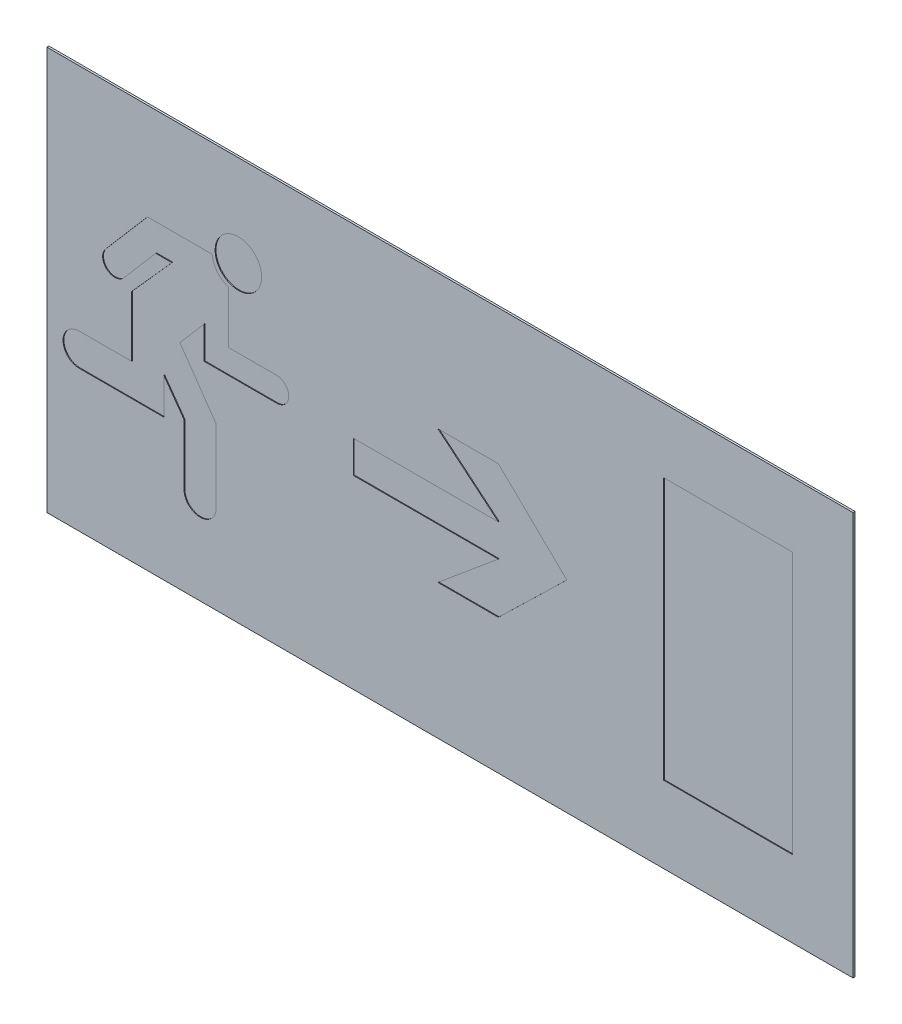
ISO-10303-21;
HEADER;
FILE_DESCRIPTION(('STEP AP214'),'2;1');
FILE_NAME('part.step','',(''),(''),'','','');
FILE_SCHEMA(('AUTOMOTIVE_DESIGN { 1 0 10303 214 1 1 1 1 }'));
ENDSEC;
DATA;
#1=APPLICATION_CONTEXT('core data for automotive mechanical design processes');
#2=APPLICATION_PROTOCOL_DEFINITION('international standard','automotive_design',2000,#1);
#3=PRODUCT_CONTEXT('',#1,'mechanical');
#4=PRODUCT('Part','Part','',(#3));
#5=PRODUCT_RELATED_PRODUCT_CATEGORY('part','',(#4));
#6=PRODUCT_DEFINITION_FORMATION('','',#4);
#7=PRODUCT_DEFINITION_CONTEXT('part definition',#1,'design');
#8=PRODUCT_DEFINITION('design','',#6,#7);
#9=PRODUCT_DEFINITION_SHAPE('','',#8);
#10=(LENGTH_UNIT() NAMED_UNIT(*) SI_UNIT(.MILLI.,.METRE.));
#11=(NAMED_UNIT(*) PLANE_ANGLE_UNIT() SI_UNIT($,.RADIAN.));
#12=(NAMED_UNIT(*) SI_UNIT($,.STERADIAN.) SOLID_ANGLE_UNIT());
#13=UNCERTAINTY_MEASURE_WITH_UNIT(LENGTH_MEASURE(1.E-05),#10,'distance_accuracy_value','');
#14=(GEOMETRIC_REPRESENTATION_CONTEXT(3) GLOBAL_UNCERTAINTY_ASSIGNED_CONTEXT((#13)) GLOBAL_UNIT_ASSIGNED_CONTEXT((#10,
#11,#12)) REPRESENTATION_CONTEXT('',''));
#15=CARTESIAN_POINT('',(0.,0.,0.));
#16=DIRECTION('',(0.,0.,1.));
#17=DIRECTION('',(1.,0.,0.));
#18=AXIS2_PLACEMENT_3D('',#15,#16,#17);
#19=CARTESIAN_POINT('',(-100.,50.,0.5));
#20=DIRECTION('',(1.,0.,0.));
#21=DIRECTION('',(0.,1.,0.));
#22=AXIS2_PLACEMENT_3D('',#19,#20,#21);
#23=PLANE('',#22);
#24=DIRECTION('',(0.,-1.,0.));
#25=VECTOR('',#24,1.);
#26=CARTESIAN_POINT('',(-100.,50.,0.));
#27=LINE('',#26,#25);
#28=CARTESIAN_POINT('',(-100.,50.,0.));
#29=VERTEX_POINT('',#28);
#30=CARTESIAN_POINT('',(-100.,-50.,0.));
#31=VERTEX_POINT('',#30);
#32=EDGE_CURVE('E577',#29,#31,#27,.T.);
#33=ORIENTED_EDGE('',*,*,#32,.T.);
#34=DIRECTION('',(0.,0.,-1.));
#35=VECTOR('',#34,1.);
#36=CARTESIAN_POINT('',(-100.,-50.,0.5));
#37=LINE('',#36,#35);
#38=CARTESIAN_POINT('',(-100.,-50.,0.5));
#39=VERTEX_POINT('',#38);
#40=EDGE_CURVE('E11',#39,#31,#37,.T.);
#41=ORIENTED_EDGE('',*,*,#40,.F.);
#42=DIRECTION('',(0.,-1.,0.));
#43=VECTOR('',#42,1.);
#44=CARTESIAN_POINT('',(-100.,50.,0.5));
#45=LINE('',#44,#43);
#46=CARTESIAN_POINT('',(-100.,50.,0.5));
#47=VERTEX_POINT('',#46);
#48=EDGE_CURVE('E592',#47,#39,#45,.T.);
#49=ORIENTED_EDGE('',*,*,#48,.F.);
#50=DIRECTION('',(0.,0.,-1.));
#51=VECTOR('',#50,1.);
#52=CARTESIAN_POINT('',(-100.,50.,0.5));
#53=LINE('',#52,#51);
#54=EDGE_CURVE('E601',#47,#29,#53,.T.);
#55=ORIENTED_EDGE('',*,*,#54,.T.);
#56=EDGE_LOOP('',(#33,#41,#49,#55));
#57=FACE_BOUND('',#56,.T.);
#58=ADVANCED_FACE('F32',(#57),#23,.F.);
#59=CARTESIAN_POINT('',(-100.,-50.,0.5));
#60=DIRECTION('',(0.,1.,0.));
#61=DIRECTION('',(0.,0.,1.));
#62=AXIS2_PLACEMENT_3D('',#59,#60,#61);
#63=PLANE('',#62);
#64=DIRECTION('',(1.,0.,0.));
#65=VECTOR('',#64,1.);
#66=CARTESIAN_POINT('',(-100.,-50.,0.));
#67=LINE('',#66,#65);
#68=CARTESIAN_POINT('',(100.,-50.,0.));
#69=VERTEX_POINT('',#68);
#70=EDGE_CURVE('E586',#31,#69,#67,.T.);
#71=ORIENTED_EDGE('',*,*,#70,.T.);
#72=DIRECTION('',(0.,0.,-1.));
#73=VECTOR('',#72,1.);
#74=CARTESIAN_POINT('',(100.,-50.,0.5));
#75=LINE('',#74,#73);
#76=CARTESIAN_POINT('',(100.,-50.,0.5));
#77=VERTEX_POINT('',#76);
#78=EDGE_CURVE('E39',#77,#69,#75,.T.);
#79=ORIENTED_EDGE('',*,*,#78,.F.);
#80=DIRECTION('',(1.,0.,0.));
#81=VECTOR('',#80,1.);
#82=CARTESIAN_POINT('',(-100.,-50.,0.5));
#83=LINE('',#82,#81);
#84=EDGE_CURVE('E595',#39,#77,#83,.T.);
#85=ORIENTED_EDGE('',*,*,#84,.F.);
#86=ORIENTED_EDGE('',*,*,#40,.T.);
#87=EDGE_LOOP('',(#71,#79,#85,#86));
#88=FACE_BOUND('',#87,.T.);
#89=ADVANCED_FACE('F626',(#88),#63,.F.);
#90=CARTESIAN_POINT('',(100.,50.,0.5));
#91=DIRECTION('',(-1.,0.,0.));
#92=DIRECTION('',(0.,-1.,0.));
#93=AXIS2_PLACEMENT_3D('',#90,#91,#92);
#94=PLANE('',#93);
#95=DIRECTION('',(0.,1.,0.));
#96=VECTOR('',#95,1.);
#97=CARTESIAN_POINT('',(100.,50.,0.));
#98=LINE('',#97,#96);
#99=CARTESIAN_POINT('',(100.,50.,0.));
#100=VERTEX_POINT('',#99);
#101=EDGE_CURVE('E588',#69,#100,#98,.T.);
#102=ORIENTED_EDGE('',*,*,#101,.T.);
#103=DIRECTION('',(0.,0.,-1.));
#104=VECTOR('',#103,1.);
#105=CARTESIAN_POINT('',(100.,50.,0.5));
#106=LINE('',#105,#104);
#107=CARTESIAN_POINT('',(100.,50.,0.5));
#108=VERTEX_POINT('',#107);
#109=EDGE_CURVE('E604',#108,#100,#106,.T.);
#110=ORIENTED_EDGE('',*,*,#109,.F.);
#111=DIRECTION('',(0.,1.,0.));
#112=VECTOR('',#111,1.);
#113=CARTESIAN_POINT('',(100.,50.,0.5));
#114=LINE('',#113,#112);
#115=EDGE_CURVE('E597',#77,#108,#114,.T.);
#116=ORIENTED_EDGE('',*,*,#115,.F.);
#117=ORIENTED_EDGE('',*,*,#78,.T.);
#118=EDGE_LOOP('',(#102,#110,#116,#117));
#119=FACE_BOUND('',#118,.T.);
#120=ADVANCED_FACE('F611',(#119),#94,.F.);
#121=CARTESIAN_POINT('',(-100.,50.,0.5));
#122=DIRECTION('',(0.,-1.,0.));
#123=DIRECTION('',(0.,0.,-1.));
#124=AXIS2_PLACEMENT_3D('',#121,#122,#123);
#125=PLANE('',#124);
#126=DIRECTION('',(-1.,0.,0.));
#127=VECTOR('',#126,1.);
#128=CARTESIAN_POINT('',(-100.,50.,0.));
#129=LINE('',#128,#127);
#130=EDGE_CURVE('E590',#100,#29,#129,.T.);
#131=ORIENTED_EDGE('',*,*,#130,.T.);
#132=ORIENTED_EDGE('',*,*,#54,.F.);
#133=DIRECTION('',(-1.,0.,0.));
#134=VECTOR('',#133,1.);
#135=CARTESIAN_POINT('',(-100.,50.,0.5));
#136=LINE('',#135,#134);
#137=EDGE_CURVE('E599',#108,#47,#136,.T.);
#138=ORIENTED_EDGE('',*,*,#137,.F.);
#139=ORIENTED_EDGE('',*,*,#109,.T.);
#140=EDGE_LOOP('',(#131,#132,#138,#139));
#141=FACE_BOUND('',#140,.T.);
#142=ADVANCED_FACE('F620',(#141),#125,.F.);
#143=CARTESIAN_POINT('',(-100.,-50.,0.5));
#144=DIRECTION('',(0.,0.,1.));
#145=DIRECTION('',(1.,0.,0.));
#146=AXIS2_PLACEMENT_3D('',#143,#144,#145);
#147=PLANE('',#146);
#148=CARTESIAN_POINT('',(-52.5,27.25,0.5));
#149=DIRECTION('',(0.,0.,1.));
#150=DIRECTION('',(1.,0.,0.));
#151=AXIS2_PLACEMENT_3D('',#148,#149,#150);
#152=CIRCLE('',#151,5.76777082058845);
#153=CARTESIAN_POINT('',(-46.7322291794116,27.25,0.5));
#154=VERTEX_POINT('',#153);
#155=EDGE_CURVE('E803',#154,#154,#152,.T.);
#156=ORIENTED_EDGE('',*,*,#155,.F.);
#157=EDGE_LOOP('',(#156));
#158=FACE_BOUND('',#157,.T.);
#159=DIRECTION('',(-0.666116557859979,-0.745847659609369,0.));
#160=VECTOR('',#159,1.);
#161=CARTESIAN_POINT('',(-79.,7.99999999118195,0.5));
#162=LINE('',#161,#160);
#163=CARTESIAN_POINT('',(-69.,19.1969542,0.5));
#164=VERTEX_POINT('',#163);
#165=CARTESIAN_POINT('',(-79.,7.99999999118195,0.5));
#166=VERTEX_POINT('',#165);
#167=EDGE_CURVE('E46',#164,#166,#162,.T.);
#168=ORIENTED_EDGE('',*,*,#167,.F.);
#169=DIRECTION('',(1.,0.,0.));
#170=VECTOR('',#169,1.);
#171=CARTESIAN_POINT('',(-69.,19.1969542,0.5));
#172=LINE('',#171,#170);
#173=CARTESIAN_POINT('',(-73.,19.1969542,0.5));
#174=VERTEX_POINT('',#173);
#175=EDGE_CURVE('E370',#174,#164,#172,.T.);
#176=ORIENTED_EDGE('',*,*,#175,.F.);
#177=DIRECTION('',(0.651634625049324,0.758533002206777,0.));
#178=VECTOR('',#177,1.);
#179=CARTESIAN_POINT('',(-73.,19.1969542,0.5));
#180=LINE('',#179,#178);
#181=CARTESIAN_POINT('',(-80.9008478,9.99999999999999,0.5));
#182=VERTEX_POINT('',#181);
#183=EDGE_CURVE('E367',#182,#174,#180,.T.);
#184=ORIENTED_EDGE('',*,*,#183,.F.);
#185=CARTESIAN_POINT('',(-83.1764468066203,11.954903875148,0.5));
#186=DIRECTION('',(0.,0.,1.));
#187=DIRECTION('',(1.,0.,0.));
#188=AXIS2_PLACEMENT_3D('',#185,#186,#187);
#189=CIRCLE('',#188,3.);
#190=CARTESIAN_POINT('',(-85.45204581,13.9098077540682,0.5));
#191=VERTEX_POINT('',#190);
#192=EDGE_CURVE('E364',#191,#182,#189,.T.);
#193=ORIENTED_EDGE('',*,*,#192,.F.);
#194=DIRECTION('',(-0.651634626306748,-0.758533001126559,0.));
#195=VECTOR('',#194,1.);
#196=CARTESIAN_POINT('',(-85.45204581,13.9098077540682,0.5));
#197=LINE('',#196,#195);
#198=CARTESIAN_POINT('',(-75.06569758,25.9999999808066,0.5));
#199=VERTEX_POINT('',#198);
#200=EDGE_CURVE('E361',#199,#191,#197,.T.);
#201=ORIENTED_EDGE('',*,*,#200,.F.);
#202=DIRECTION('',(-1.,0.,0.));
#203=VECTOR('',#202,1.);
#204=CARTESIAN_POINT('',(-75.06569758,25.9999999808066,0.5));
#205=LINE('',#204,#203);
#206=CARTESIAN_POINT('',(-59.,25.9999999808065,0.5));
#207=VERTEX_POINT('',#206);
#208=EDGE_CURVE('E358',#207,#199,#205,.T.);
#209=ORIENTED_EDGE('',*,*,#208,.F.);
#210=CARTESIAN_POINT('',(-53.3208897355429,26.4432882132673,0.5));
#211=DIRECTION('',(0.,0.,-1.));
#212=DIRECTION('',(1.,0.,0.));
#213=AXIS2_PLACEMENT_3D('',#210,#211,#212);
#214=CIRCLE('',#213,5.69638463);
#215=CARTESIAN_POINT('',(-55.,21.,0.5));
#216=VERTEX_POINT('',#215);
#217=EDGE_CURVE('E355',#216,#207,#214,.T.);
#218=ORIENTED_EDGE('',*,*,#217,.F.);
#219=DIRECTION('',(0.,1.,0.));
#220=VECTOR('',#219,1.);
#221=CARTESIAN_POINT('',(-55.,21.,0.5));
#222=LINE('',#221,#220);
#223=CARTESIAN_POINT('',(-55.,7.99999999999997,0.5));
#224=VERTEX_POINT('',#223);
#225=EDGE_CURVE('E352',#224,#216,#222,.T.);
#226=ORIENTED_EDGE('',*,*,#225,.F.);
#227=DIRECTION('',(-1.,0.,0.));
#228=VECTOR('',#227,1.);
#229=CARTESIAN_POINT('',(-55.,7.99999999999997,0.5));
#230=LINE('',#229,#228);
#231=CARTESIAN_POINT('',(-43.,7.99999999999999,0.5));
#232=VERTEX_POINT('',#231);
#233=EDGE_CURVE('E349',#232,#224,#230,.T.);
#234=ORIENTED_EDGE('',*,*,#233,.F.);
#235=CARTESIAN_POINT('',(-43.,4.99999999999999,0.5));
#236=DIRECTION('',(0.,0.,1.));
#237=DIRECTION('',(1.,0.,0.));
#238=AXIS2_PLACEMENT_3D('',#235,#236,#237);
#239=CIRCLE('',#238,3.);
#240=CARTESIAN_POINT('',(-43.,1.99999999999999,0.5));
#241=VERTEX_POINT('',#240);
#242=EDGE_CURVE('E346',#241,#232,#239,.T.);
#243=ORIENTED_EDGE('',*,*,#242,.F.);
#244=DIRECTION('',(1.,0.,0.));
#245=VECTOR('',#244,1.);
#246=CARTESIAN_POINT('',(-61.,1.99999999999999,0.5));
#247=LINE('',#246,#245);
#248=CARTESIAN_POINT('',(-61.,1.99999999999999,0.5));
#249=VERTEX_POINT('',#248);
#250=EDGE_CURVE('E343',#249,#241,#247,.T.);
#251=ORIENTED_EDGE('',*,*,#250,.F.);
#252=DIRECTION('',(0.,-1.,0.));
#253=VECTOR('',#252,1.);
#254=CARTESIAN_POINT('',(-61.,9.99999999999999,0.5));
#255=LINE('',#254,#253);
#256=CARTESIAN_POINT('',(-61.,9.99999999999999,0.5));
#257=VERTEX_POINT('',#256);
#258=EDGE_CURVE('E340',#257,#249,#255,.T.);
#259=ORIENTED_EDGE('',*,*,#258,.F.);
#260=DIRECTION('',(0.650791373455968,0.759256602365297,0.));
#261=VECTOR('',#260,1.);
#262=CARTESIAN_POINT('',(-67.,3.,0.5));
#263=LINE('',#262,#261);
#264=CARTESIAN_POINT('',(-67.,3.,0.5));
#265=VERTEX_POINT('',#264);
#266=EDGE_CURVE('E337',#265,#257,#263,.T.);
#267=ORIENTED_EDGE('',*,*,#266,.F.);
#268=DIRECTION('',(-0.569209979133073,0.822192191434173,0.));
#269=VECTOR('',#268,1.);
#270=CARTESIAN_POINT('',(-57.99999999,-10.0000000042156,0.5));
#271=LINE('',#270,#269);
#272=CARTESIAN_POINT('',(-57.99999999,-10.0000000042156,0.5));
#273=VERTEX_POINT('',#272);
#274=EDGE_CURVE('E334',#273,#265,#271,.T.);
#275=ORIENTED_EDGE('',*,*,#274,.F.);
#276=DIRECTION('',(0.,1.,0.));
#277=VECTOR('',#276,1.);
#278=CARTESIAN_POINT('',(-57.99999999,-28.,0.5));
#279=LINE('',#278,#277);
#280=CARTESIAN_POINT('',(-57.99999999,-28.,0.5));
#281=VERTEX_POINT('',#280);
#282=EDGE_CURVE('E331',#281,#273,#279,.T.);
#283=ORIENTED_EDGE('',*,*,#282,.F.);
#284=CARTESIAN_POINT('',(-61.99999999,-28.,0.5));
#285=DIRECTION('',(0.,0.,1.));
#286=DIRECTION('',(1.,0.,0.));
#287=AXIS2_PLACEMENT_3D('',#284,#285,#286);
#288=CIRCLE('',#287,4.00000000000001);
#289=CARTESIAN_POINT('',(-65.99999999,-28.,0.5));
#290=VERTEX_POINT('',#289);
#291=EDGE_CURVE('E328',#290,#281,#288,.T.);
#292=ORIENTED_EDGE('',*,*,#291,.F.);
#293=DIRECTION('',(0.,-1.,0.));
#294=VECTOR('',#293,1.);
#295=CARTESIAN_POINT('',(-65.99999999,-13.,0.5));
#296=LINE('',#295,#294);
#297=CARTESIAN_POINT('',(-65.99999999,-13.,0.5));
#298=VERTEX_POINT('',#297);
#299=EDGE_CURVE('E325',#298,#290,#296,.T.);
#300=ORIENTED_EDGE('',*,*,#299,.F.);
#301=DIRECTION('',(0.58123819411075,-0.813733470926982,0.));
#302=VECTOR('',#301,1.);
#303=CARTESIAN_POINT('',(-70.9999999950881,-6.00000000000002,0.5));
#304=LINE('',#303,#302);
#305=CARTESIAN_POINT('',(-70.9999999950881,-6.00000000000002,0.5));
#306=VERTEX_POINT('',#305);
#307=EDGE_CURVE('E322',#306,#298,#304,.T.);
#308=ORIENTED_EDGE('',*,*,#307,.F.);
#309=DIRECTION('',(0.,1.,0.));
#310=VECTOR('',#309,1.);
#311=CARTESIAN_POINT('',(-70.9999999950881,-15.,0.5));
#312=LINE('',#311,#310);
#313=CARTESIAN_POINT('',(-70.9999999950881,-15.,0.5));
#314=VERTEX_POINT('',#313);
#315=EDGE_CURVE('E319',#314,#306,#312,.T.);
#316=ORIENTED_EDGE('',*,*,#315,.F.);
#317=DIRECTION('',(1.,0.,0.));
#318=VECTOR('',#317,1.);
#319=CARTESIAN_POINT('',(-92.,-15.,0.5));
#320=LINE('',#319,#318);
#321=CARTESIAN_POINT('',(-92.,-15.,0.5));
#322=VERTEX_POINT('',#321);
#323=EDGE_CURVE('E313',#322,#314,#320,.T.);
#324=ORIENTED_EDGE('',*,*,#323,.F.);
#325=CARTESIAN_POINT('',(-92.,-11.,0.5));
#326=DIRECTION('',(0.,0.,1.));
#327=DIRECTION('',(1.,0.,0.));
#328=AXIS2_PLACEMENT_3D('',#325,#326,#327);
#329=CIRCLE('',#328,4.);
#330=CARTESIAN_POINT('',(-92.,-7.,0.5));
#331=VERTEX_POINT('',#330);
#332=EDGE_CURVE('E311',#331,#322,#329,.T.);
#333=ORIENTED_EDGE('',*,*,#332,.F.);
#334=DIRECTION('',(-1.,0.,0.));
#335=VECTOR('',#334,1.);
#336=CARTESIAN_POINT('',(-92.,-7.,0.5));
#337=LINE('',#336,#335);
#338=CARTESIAN_POINT('',(-79.,-7.,0.5));
#339=VERTEX_POINT('',#338);
#340=EDGE_CURVE('E292',#339,#331,#337,.T.);
#341=ORIENTED_EDGE('',*,*,#340,.F.);
#342=DIRECTION('',(0.,-1.,0.));
#343=VECTOR('',#342,1.);
#344=CARTESIAN_POINT('',(-79.,-7.,0.5));
#345=LINE('',#344,#343);
#346=EDGE_CURVE('E303',#166,#339,#345,.T.);
#347=ORIENTED_EDGE('',*,*,#346,.F.);
#348=EDGE_LOOP('',(#168,#176,#184,#193,#201,#209,#218,#226,#234,#243,#251,#259,#267,#275,#283,
#292,#300,#308,#316,#324,#333,#341,#347));
#349=FACE_BOUND('',#348,.T.);
#350=DIRECTION('',(-1.,0.,0.));
#351=VECTOR('',#350,1.);
#352=CARTESIAN_POINT('',(12.0000000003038,4.,0.5));
#353=LINE('',#352,#351);
#354=CARTESIAN_POINT('',(12.0000000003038,4.,0.5));
#355=VERTEX_POINT('',#354);
#356=CARTESIAN_POINT('',(-24.,4.,0.5));
#357=VERTEX_POINT('',#356);
#358=EDGE_CURVE('E54',#355,#357,#353,.T.);
#359=ORIENTED_EDGE('',*,*,#358,.F.);
#360=DIRECTION('',(0.768221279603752,-0.640184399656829,0.));
#361=VECTOR('',#360,1.);
#362=CARTESIAN_POINT('',(-3.00000000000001,16.5,0.5));
#363=LINE('',#362,#361);
#364=CARTESIAN_POINT('',(-3.00000000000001,16.5,0.5));
#365=VERTEX_POINT('',#364);
#366=EDGE_CURVE('E503',#365,#355,#363,.T.);
#367=ORIENTED_EDGE('',*,*,#366,.F.);
#368=DIRECTION('',(-1.,0.,0.));
#369=VECTOR('',#368,1.);
#370=CARTESIAN_POINT('',(12.,16.5,0.5));
#371=LINE('',#370,#369);
#372=CARTESIAN_POINT('',(12.,16.5,0.5));
#373=VERTEX_POINT('',#372);
#374=EDGE_CURVE('E500',#373,#365,#371,.T.);
#375=ORIENTED_EDGE('',*,*,#374,.F.);
#376=DIRECTION('',(-0.717580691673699,0.696475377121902,0.));
#377=VECTOR('',#376,1.);
#378=CARTESIAN_POINT('',(12.,16.5,0.5));
#379=LINE('',#378,#377);
#380=CARTESIAN_POINT('',(29.0000000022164,0.,0.5));
#381=VERTEX_POINT('',#380);
#382=EDGE_CURVE('E497',#381,#373,#379,.T.);
#383=ORIENTED_EDGE('',*,*,#382,.F.);
#384=DIRECTION('',(0.717580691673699,0.696475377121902,0.));
#385=VECTOR('',#384,1.);
#386=CARTESIAN_POINT('',(29.0000000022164,0.,0.5));
#387=LINE('',#386,#385);
#388=CARTESIAN_POINT('',(12.,-16.5,0.5));
#389=VERTEX_POINT('',#388);
#390=EDGE_CURVE('E494',#389,#381,#387,.T.);
#391=ORIENTED_EDGE('',*,*,#390,.F.);
#392=DIRECTION('',(1.,0.,0.));
#393=VECTOR('',#392,1.);
#394=CARTESIAN_POINT('',(12.,-16.5,0.5));
#395=LINE('',#394,#393);
#396=CARTESIAN_POINT('',(-3.00000000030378,-16.5,0.5));
#397=VERTEX_POINT('',#396);
#398=EDGE_CURVE('E491',#397,#389,#395,.T.);
#399=ORIENTED_EDGE('',*,*,#398,.F.);
#400=DIRECTION('',(-0.768221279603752,-0.640184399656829,0.));
#401=VECTOR('',#400,1.);
#402=CARTESIAN_POINT('',(12.,-4.,0.5));
#403=LINE('',#402,#401);
#404=CARTESIAN_POINT('',(12.,-4.,0.5));
#405=VERTEX_POINT('',#404);
#406=EDGE_CURVE('E488',#405,#397,#403,.T.);
#407=ORIENTED_EDGE('',*,*,#406,.F.);
#408=DIRECTION('',(1.,0.,0.));
#409=VECTOR('',#408,1.);
#410=CARTESIAN_POINT('',(-24.,-4.,0.5));
#411=LINE('',#410,#409);
#412=CARTESIAN_POINT('',(-24.,-4.,0.5));
#413=VERTEX_POINT('',#412);
#414=EDGE_CURVE('E485',#413,#405,#411,.T.);
#415=ORIENTED_EDGE('',*,*,#414,.F.);
#416=DIRECTION('',(0.,-1.,0.));
#417=VECTOR('',#416,1.);
#418=CARTESIAN_POINT('',(-24.,4.,0.5));
#419=LINE('',#418,#417);
#420=EDGE_CURVE('E482',#357,#413,#419,.T.);
#421=ORIENTED_EDGE('',*,*,#420,.F.);
#422=EDGE_LOOP('',(#359,#367,#375,#383,#391,#399,#407,#415,#421));
#423=FACE_BOUND('',#422,.T.);
#424=DIRECTION('',(0.,-1.,0.));
#425=VECTOR('',#424,1.);
#426=CARTESIAN_POINT('',(53.,34.,0.5));
#427=LINE('',#426,#425);
#428=CARTESIAN_POINT('',(53.,34.,0.5));
#429=VERTEX_POINT('',#428);
#430=CARTESIAN_POINT('',(53.,-31.,0.5));
#431=VERTEX_POINT('',#430);
#432=EDGE_CURVE('E536',#429,#431,#427,.T.);
#433=ORIENTED_EDGE('',*,*,#432,.F.);
#434=DIRECTION('',(-1.,0.,0.));
#435=VECTOR('',#434,1.);
#436=CARTESIAN_POINT('',(53.,34.,0.5));
#437=LINE('',#436,#435);
#438=CARTESIAN_POINT('',(85.,34.,0.5));
#439=VERTEX_POINT('',#438);
#440=EDGE_CURVE('E559',#439,#429,#437,.T.);
#441=ORIENTED_EDGE('',*,*,#440,.F.);
#442=DIRECTION('',(0.,1.,0.));
#443=VECTOR('',#442,1.);
#444=CARTESIAN_POINT('',(85.,34.,0.5));
#445=LINE('',#444,#443);
#446=CARTESIAN_POINT('',(85.,-31.,0.5));
#447=VERTEX_POINT('',#446);
#448=EDGE_CURVE('E556',#447,#439,#445,.T.);
#449=ORIENTED_EDGE('',*,*,#448,.F.);
#450=DIRECTION('',(1.,0.,0.));
#451=VECTOR('',#450,1.);
#452=CARTESIAN_POINT('',(53.,-31.,0.5));
#453=LINE('',#452,#451);
#454=EDGE_CURVE('E553',#431,#447,#453,.T.);
#455=ORIENTED_EDGE('',*,*,#454,.F.);
#456=EDGE_LOOP('',(#433,#441,#449,#455));
#457=FACE_BOUND('',#456,.T.);
#458=ORIENTED_EDGE('',*,*,#48,.T.);
#459=ORIENTED_EDGE('',*,*,#84,.T.);
#460=ORIENTED_EDGE('',*,*,#115,.T.);
#461=ORIENTED_EDGE('',*,*,#137,.T.);
#462=EDGE_LOOP('',(#458,#459,#460,#461));
#463=FACE_BOUND('',#462,.T.);
#464=ADVANCED_FACE('F307',(#158,#349,#423,#457,#463),#147,.T.);
#465=CARTESIAN_POINT('',(-100.,-50.,0.));
#466=DIRECTION('',(0.,0.,1.));
#467=DIRECTION('',(1.,0.,0.));
#468=AXIS2_PLACEMENT_3D('',#465,#466,#467);
#469=PLANE('',#468);
#470=ORIENTED_EDGE('',*,*,#32,.F.);
#471=ORIENTED_EDGE('',*,*,#130,.F.);
#472=ORIENTED_EDGE('',*,*,#101,.F.);
#473=ORIENTED_EDGE('',*,*,#70,.F.);
#474=EDGE_LOOP('',(#470,#471,#472,#473));
#475=FACE_BOUND('',#474,.T.);
#476=ADVANCED_FACE('F617',(#475),#469,.F.);
#477=CARTESIAN_POINT('',(53.,34.,0.3));
#478=DIRECTION('',(-1.,0.,0.));
#479=DIRECTION('',(0.,-1.,0.));
#480=AXIS2_PLACEMENT_3D('',#477,#478,#479);
#481=PLANE('',#480);
#482=ORIENTED_EDGE('',*,*,#432,.T.);
#483=DIRECTION('',(0.,0.,1.));
#484=VECTOR('',#483,1.);
#485=CARTESIAN_POINT('',(53.,-31.,0.3));
#486=LINE('',#485,#484);
#487=CARTESIAN_POINT('',(53.,-31.,0.3));
#488=VERTEX_POINT('',#487);
#489=EDGE_CURVE('E574',#488,#431,#486,.T.);
#490=ORIENTED_EDGE('',*,*,#489,.F.);
#491=DIRECTION('',(0.,-1.,0.));
#492=VECTOR('',#491,1.);
#493=CARTESIAN_POINT('',(53.,34.,0.3));
#494=LINE('',#493,#492);
#495=CARTESIAN_POINT('',(53.,34.,0.3));
#496=VERTEX_POINT('',#495);
#497=EDGE_CURVE('E562',#496,#488,#494,.T.);
#498=ORIENTED_EDGE('',*,*,#497,.F.);
#499=DIRECTION('',(0.,0.,1.));
#500=VECTOR('',#499,1.);
#501=CARTESIAN_POINT('',(53.,34.,0.3));
#502=LINE('',#501,#500);
#503=EDGE_CURVE('E575',#496,#429,#502,.T.);
#504=ORIENTED_EDGE('',*,*,#503,.T.);
#505=EDGE_LOOP('',(#482,#490,#498,#504));
#506=FACE_BOUND('',#505,.T.);
#507=ADVANCED_FACE('F641',(#506),#481,.F.);
#508=CARTESIAN_POINT('',(53.,34.,0.3));
#509=DIRECTION('',(0.,1.,0.));
#510=DIRECTION('',(0.,0.,1.));
#511=AXIS2_PLACEMENT_3D('',#508,#509,#510);
#512=PLANE('',#511);
#513=ORIENTED_EDGE('',*,*,#440,.T.);
#514=ORIENTED_EDGE('',*,*,#503,.F.);
#515=DIRECTION('',(-1.,0.,0.));
#516=VECTOR('',#515,1.);
#517=CARTESIAN_POINT('',(53.,34.,0.3));
#518=LINE('',#517,#516);
#519=CARTESIAN_POINT('',(85.,34.,0.3));
#520=VERTEX_POINT('',#519);
#521=EDGE_CURVE('E571',#520,#496,#518,.T.);
#522=ORIENTED_EDGE('',*,*,#521,.F.);
#523=DIRECTION('',(0.,0.,1.));
#524=VECTOR('',#523,1.);
#525=CARTESIAN_POINT('',(85.,34.,0.3));
#526=LINE('',#525,#524);
#527=EDGE_CURVE('E578',#520,#439,#526,.T.);
#528=ORIENTED_EDGE('',*,*,#527,.T.);
#529=EDGE_LOOP('',(#513,#514,#522,#528));
#530=FACE_BOUND('',#529,.T.);
#531=ADVANCED_FACE('F644',(#530),#512,.F.);
#532=CARTESIAN_POINT('',(85.,34.,0.3));
#533=DIRECTION('',(1.,0.,0.));
#534=DIRECTION('',(0.,1.,0.));
#535=AXIS2_PLACEMENT_3D('',#532,#533,#534);
#536=PLANE('',#535);
#537=ORIENTED_EDGE('',*,*,#448,.T.);
#538=ORIENTED_EDGE('',*,*,#527,.F.);
#539=DIRECTION('',(0.,1.,0.));
#540=VECTOR('',#539,1.);
#541=CARTESIAN_POINT('',(85.,34.,0.3));
#542=LINE('',#541,#540);
#543=CARTESIAN_POINT('',(85.,-31.,0.3));
#544=VERTEX_POINT('',#543);
#545=EDGE_CURVE('E568',#544,#520,#542,.T.);
#546=ORIENTED_EDGE('',*,*,#545,.F.);
#547=DIRECTION('',(0.,0.,1.));
#548=VECTOR('',#547,1.);
#549=CARTESIAN_POINT('',(85.,-31.,0.3));
#550=LINE('',#549,#548);
#551=EDGE_CURVE('E580',#544,#447,#550,.T.);
#552=ORIENTED_EDGE('',*,*,#551,.T.);
#553=EDGE_LOOP('',(#537,#538,#546,#552));
#554=FACE_BOUND('',#553,.T.);
#555=ADVANCED_FACE('F650',(#554),#536,.F.);
#556=CARTESIAN_POINT('',(53.,-31.,0.3));
#557=DIRECTION('',(0.,-1.,0.));
#558=DIRECTION('',(1.,0.,0.));
#559=AXIS2_PLACEMENT_3D('',#556,#557,#558);
#560=PLANE('',#559);
#561=ORIENTED_EDGE('',*,*,#454,.T.);
#562=ORIENTED_EDGE('',*,*,#551,.F.);
#563=DIRECTION('',(1.,0.,0.));
#564=VECTOR('',#563,1.);
#565=CARTESIAN_POINT('',(53.,-31.,0.3));
#566=LINE('',#565,#564);
#567=EDGE_CURVE('E565',#488,#544,#566,.T.);
#568=ORIENTED_EDGE('',*,*,#567,.F.);
#569=ORIENTED_EDGE('',*,*,#489,.T.);
#570=EDGE_LOOP('',(#561,#562,#568,#569));
#571=FACE_BOUND('',#570,.T.);
#572=ADVANCED_FACE('F646',(#571),#560,.F.);
#573=CARTESIAN_POINT('',(53.,34.,0.3));
#574=DIRECTION('',(0.,0.,1.));
#575=DIRECTION('',(1.,0.,0.));
#576=AXIS2_PLACEMENT_3D('',#573,#574,#575);
#577=PLANE('',#576);
#578=ORIENTED_EDGE('',*,*,#497,.T.);
#579=ORIENTED_EDGE('',*,*,#567,.T.);
#580=ORIENTED_EDGE('',*,*,#545,.T.);
#581=ORIENTED_EDGE('',*,*,#521,.T.);
#582=EDGE_LOOP('',(#578,#579,#580,#581));
#583=FACE_BOUND('',#582,.T.);
#584=ADVANCED_FACE('F649',(#583),#577,.T.);
#585=CARTESIAN_POINT('',(12.0000000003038,4.,0.3));
#586=DIRECTION('',(0.,1.,0.));
#587=DIRECTION('',(-1.,0.,0.));
#588=AXIS2_PLACEMENT_3D('',#585,#586,#587);
#589=PLANE('',#588);
#590=ORIENTED_EDGE('',*,*,#358,.T.);
#591=DIRECTION('',(0.,0.,1.));
#592=VECTOR('',#591,1.);
#593=CARTESIAN_POINT('',(-24.,4.,0.3));
#594=LINE('',#593,#592);
#595=CARTESIAN_POINT('',(-24.,4.,0.3));
#596=VERTEX_POINT('',#595);
#597=EDGE_CURVE('E533',#596,#357,#594,.T.);
#598=ORIENTED_EDGE('',*,*,#597,.F.);
#599=DIRECTION('',(-1.,0.,0.));
#600=VECTOR('',#599,1.);
#601=CARTESIAN_POINT('',(12.0000000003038,4.,0.3));
#602=LINE('',#601,#600);
#603=CARTESIAN_POINT('',(12.0000000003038,4.,0.3));
#604=VERTEX_POINT('',#603);
#605=EDGE_CURVE('E506',#604,#596,#602,.T.);
#606=ORIENTED_EDGE('',*,*,#605,.F.);
#607=DIRECTION('',(0.,0.,1.));
#608=VECTOR('',#607,1.);
#609=CARTESIAN_POINT('',(12.0000000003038,4.,0.3));
#610=LINE('',#609,#608);
#611=EDGE_CURVE('E534',#604,#355,#610,.T.);
#612=ORIENTED_EDGE('',*,*,#611,.T.);
#613=EDGE_LOOP('',(#590,#598,#606,#612));
#614=FACE_BOUND('',#613,.T.);
#615=ADVANCED_FACE('F660',(#614),#589,.F.);
#616=CARTESIAN_POINT('',(-3.00000000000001,16.5,0.3));
#617=DIRECTION('',(-0.640184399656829,-0.768221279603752,0.));
#618=DIRECTION('',(0.768221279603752,-0.640184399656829,0.));
#619=AXIS2_PLACEMENT_3D('',#616,#617,#618);
#620=PLANE('',#619);
#621=ORIENTED_EDGE('',*,*,#366,.T.);
#622=ORIENTED_EDGE('',*,*,#611,.F.);
#623=DIRECTION('',(0.768221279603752,-0.640184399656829,0.));
#624=VECTOR('',#623,1.);
#625=CARTESIAN_POINT('',(-3.00000000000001,16.5,0.3));
#626=LINE('',#625,#624);
#627=CARTESIAN_POINT('',(-3.00000000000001,16.5,0.3));
#628=VERTEX_POINT('',#627);
#629=EDGE_CURVE('E530',#628,#604,#626,.T.);
#630=ORIENTED_EDGE('',*,*,#629,.F.);
#631=DIRECTION('',(0.,0.,1.));
#632=VECTOR('',#631,1.);
#633=CARTESIAN_POINT('',(-3.00000000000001,16.5,0.3));
#634=LINE('',#633,#632);
#635=EDGE_CURVE('E537',#628,#365,#634,.T.);
#636=ORIENTED_EDGE('',*,*,#635,.T.);
#637=EDGE_LOOP('',(#621,#622,#630,#636));
#638=FACE_BOUND('',#637,.T.);
#639=ADVANCED_FACE('F664',(#638),#620,.F.);
#640=CARTESIAN_POINT('',(12.,16.5,0.3));
#641=DIRECTION('',(0.,1.,0.));
#642=DIRECTION('',(0.,0.,1.));
#643=AXIS2_PLACEMENT_3D('',#640,#641,#642);
#644=PLANE('',#643);
#645=ORIENTED_EDGE('',*,*,#374,.T.);
#646=ORIENTED_EDGE('',*,*,#635,.F.);
#647=DIRECTION('',(-1.,0.,0.));
#648=VECTOR('',#647,1.);
#649=CARTESIAN_POINT('',(12.,16.5,0.3));
#650=LINE('',#649,#648);
#651=CARTESIAN_POINT('',(12.,16.5,0.3));
#652=VERTEX_POINT('',#651);
#653=EDGE_CURVE('E527',#652,#628,#650,.T.);
#654=ORIENTED_EDGE('',*,*,#653,.F.);
#655=DIRECTION('',(0.,0.,1.));
#656=VECTOR('',#655,1.);
#657=CARTESIAN_POINT('',(12.,16.5,0.3));
#658=LINE('',#657,#656);
#659=EDGE_CURVE('E539',#652,#373,#658,.T.);
#660=ORIENTED_EDGE('',*,*,#659,.T.);
#661=EDGE_LOOP('',(#645,#646,#654,#660));
#662=FACE_BOUND('',#661,.T.);
#663=ADVANCED_FACE('F689',(#662),#644,.F.);
#664=CARTESIAN_POINT('',(12.,16.5,0.3));
#665=DIRECTION('',(0.696475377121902,0.717580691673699,0.));
#666=DIRECTION('',(-0.717580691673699,0.696475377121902,0.));
#667=AXIS2_PLACEMENT_3D('',#664,#665,#666);
#668=PLANE('',#667);
#669=ORIENTED_EDGE('',*,*,#382,.T.);
#670=ORIENTED_EDGE('',*,*,#659,.F.);
#671=DIRECTION('',(-0.717580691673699,0.696475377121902,0.));
#672=VECTOR('',#671,1.);
#673=CARTESIAN_POINT('',(12.,16.5,0.3));
#674=LINE('',#673,#672);
#675=CARTESIAN_POINT('',(29.0000000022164,0.,0.3));
#676=VERTEX_POINT('',#675);
#677=EDGE_CURVE('E524',#676,#652,#674,.T.);
#678=ORIENTED_EDGE('',*,*,#677,.F.);
#679=DIRECTION('',(0.,0.,1.));
#680=VECTOR('',#679,1.);
#681=CARTESIAN_POINT('',(29.0000000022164,0.,0.3));
#682=LINE('',#681,#680);
#683=EDGE_CURVE('E541',#676,#381,#682,.T.);
#684=ORIENTED_EDGE('',*,*,#683,.T.);
#685=EDGE_LOOP('',(#669,#670,#678,#684));
#686=FACE_BOUND('',#685,.T.);
#687=ADVANCED_FACE('F685',(#686),#668,.F.);
#688=CARTESIAN_POINT('',(29.0000000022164,0.,0.3));
#689=DIRECTION('',(0.696475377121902,-0.717580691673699,0.));
#690=DIRECTION('',(0.717580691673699,0.696475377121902,0.));
#691=AXIS2_PLACEMENT_3D('',#688,#689,#690);
#692=PLANE('',#691);
#693=ORIENTED_EDGE('',*,*,#390,.T.);
#694=ORIENTED_EDGE('',*,*,#683,.F.);
#695=DIRECTION('',(0.717580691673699,0.696475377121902,0.));
#696=VECTOR('',#695,1.);
#697=CARTESIAN_POINT('',(29.0000000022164,0.,0.3));
#698=LINE('',#697,#696);
#699=CARTESIAN_POINT('',(12.,-16.5,0.3));
#700=VERTEX_POINT('',#699);
#701=EDGE_CURVE('E521',#700,#676,#698,.T.);
#702=ORIENTED_EDGE('',*,*,#701,.F.);
#703=DIRECTION('',(0.,0.,1.));
#704=VECTOR('',#703,1.);
#705=CARTESIAN_POINT('',(12.,-16.5,0.3));
#706=LINE('',#705,#704);
#707=EDGE_CURVE('E543',#700,#389,#706,.T.);
#708=ORIENTED_EDGE('',*,*,#707,.T.);
#709=EDGE_LOOP('',(#693,#694,#702,#708));
#710=FACE_BOUND('',#709,.T.);
#711=ADVANCED_FACE('F681',(#710),#692,.F.);
#712=CARTESIAN_POINT('',(12.,-16.5,0.3));
#713=DIRECTION('',(0.,-1.,0.));
#714=DIRECTION('',(1.,0.,0.));
#715=AXIS2_PLACEMENT_3D('',#712,#713,#714);
#716=PLANE('',#715);
#717=ORIENTED_EDGE('',*,*,#398,.T.);
#718=ORIENTED_EDGE('',*,*,#707,.F.);
#719=DIRECTION('',(1.,0.,0.));
#720=VECTOR('',#719,1.);
#721=CARTESIAN_POINT('',(12.,-16.5,0.3));
#722=LINE('',#721,#720);
#723=CARTESIAN_POINT('',(-3.00000000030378,-16.5,0.3));
#724=VERTEX_POINT('',#723);
#725=EDGE_CURVE('E518',#724,#700,#722,.T.);
#726=ORIENTED_EDGE('',*,*,#725,.F.);
#727=DIRECTION('',(0.,0.,1.));
#728=VECTOR('',#727,1.);
#729=CARTESIAN_POINT('',(-3.00000000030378,-16.5,0.3));
#730=LINE('',#729,#728);
#731=EDGE_CURVE('E545',#724,#397,#730,.T.);
#732=ORIENTED_EDGE('',*,*,#731,.T.);
#733=EDGE_LOOP('',(#717,#718,#726,#732));
#734=FACE_BOUND('',#733,.T.);
#735=ADVANCED_FACE('F677',(#734),#716,.F.);
#736=CARTESIAN_POINT('',(12.,-4.,0.3));
#737=DIRECTION('',(-0.640184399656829,0.768221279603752,0.));
#738=DIRECTION('',(-0.768221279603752,-0.640184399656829,0.));
#739=AXIS2_PLACEMENT_3D('',#736,#737,#738);
#740=PLANE('',#739);
#741=ORIENTED_EDGE('',*,*,#406,.T.);
#742=ORIENTED_EDGE('',*,*,#731,.F.);
#743=DIRECTION('',(-0.768221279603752,-0.640184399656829,0.));
#744=VECTOR('',#743,1.);
#745=CARTESIAN_POINT('',(12.,-4.,0.3));
#746=LINE('',#745,#744);
#747=CARTESIAN_POINT('',(12.,-4.,0.3));
#748=VERTEX_POINT('',#747);
#749=EDGE_CURVE('E515',#748,#724,#746,.T.);
#750=ORIENTED_EDGE('',*,*,#749,.F.);
#751=DIRECTION('',(0.,0.,1.));
#752=VECTOR('',#751,1.);
#753=CARTESIAN_POINT('',(12.,-4.,0.3));
#754=LINE('',#753,#752);
#755=EDGE_CURVE('E547',#748,#405,#754,.T.);
#756=ORIENTED_EDGE('',*,*,#755,.T.);
#757=EDGE_LOOP('',(#741,#742,#750,#756));
#758=FACE_BOUND('',#757,.T.);
#759=ADVANCED_FACE('F673',(#758),#740,.F.);
#760=CARTESIAN_POINT('',(-24.,-4.,0.3));
#761=DIRECTION('',(0.,-1.,0.));
#762=DIRECTION('',(0.,0.,-1.));
#763=AXIS2_PLACEMENT_3D('',#760,#761,#762);
#764=PLANE('',#763);
#765=ORIENTED_EDGE('',*,*,#414,.T.);
#766=ORIENTED_EDGE('',*,*,#755,.F.);
#767=DIRECTION('',(1.,0.,0.));
#768=VECTOR('',#767,1.);
#769=CARTESIAN_POINT('',(-24.,-4.,0.3));
#770=LINE('',#769,#768);
#771=CARTESIAN_POINT('',(-24.,-4.,0.3));
#772=VERTEX_POINT('',#771);
#773=EDGE_CURVE('E512',#772,#748,#770,.T.);
#774=ORIENTED_EDGE('',*,*,#773,.F.);
#775=DIRECTION('',(0.,0.,1.));
#776=VECTOR('',#775,1.);
#777=CARTESIAN_POINT('',(-24.,-4.,0.3));
#778=LINE('',#777,#776);
#779=EDGE_CURVE('E549',#772,#413,#778,.T.);
#780=ORIENTED_EDGE('',*,*,#779,.T.);
#781=EDGE_LOOP('',(#765,#766,#774,#780));
#782=FACE_BOUND('',#781,.T.);
#783=ADVANCED_FACE('F669',(#782),#764,.F.);
#784=CARTESIAN_POINT('',(-24.,4.,0.3));
#785=DIRECTION('',(-1.,0.,0.));
#786=DIRECTION('',(0.,0.,1.));
#787=AXIS2_PLACEMENT_3D('',#784,#785,#786);
#788=PLANE('',#787);
#789=ORIENTED_EDGE('',*,*,#420,.T.);
#790=ORIENTED_EDGE('',*,*,#779,.F.);
#791=DIRECTION('',(0.,-1.,0.));
#792=VECTOR('',#791,1.);
#793=CARTESIAN_POINT('',(-24.,4.,0.3));
#794=LINE('',#793,#792);
#795=EDGE_CURVE('E509',#596,#772,#794,.T.);
#796=ORIENTED_EDGE('',*,*,#795,.F.);
#797=ORIENTED_EDGE('',*,*,#597,.T.);
#798=EDGE_LOOP('',(#789,#790,#796,#797));
#799=FACE_BOUND('',#798,.T.);
#800=ADVANCED_FACE('F665',(#799),#788,.F.);
#801=CARTESIAN_POINT('',(-24.,4.,0.3));
#802=DIRECTION('',(0.,0.,1.));
#803=DIRECTION('',(1.,0.,0.));
#804=AXIS2_PLACEMENT_3D('',#801,#802,#803);
#805=PLANE('',#804);
#806=ORIENTED_EDGE('',*,*,#605,.T.);
#807=ORIENTED_EDGE('',*,*,#795,.T.);
#808=ORIENTED_EDGE('',*,*,#773,.T.);
#809=ORIENTED_EDGE('',*,*,#749,.T.);
#810=ORIENTED_EDGE('',*,*,#725,.T.);
#811=ORIENTED_EDGE('',*,*,#701,.T.);
#812=ORIENTED_EDGE('',*,*,#677,.T.);
#813=ORIENTED_EDGE('',*,*,#653,.T.);
#814=ORIENTED_EDGE('',*,*,#629,.T.);
#815=EDGE_LOOP('',(#806,#807,#808,#809,#810,#811,#812,#813,#814));
#816=FACE_BOUND('',#815,.T.);
#817=ADVANCED_FACE('F668',(#816),#805,.T.);
#818=CARTESIAN_POINT('',(-79.,7.99999999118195,0.3));
#819=DIRECTION('',(-0.745847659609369,0.666116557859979,0.));
#820=DIRECTION('',(-0.666116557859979,-0.745847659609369,0.));
#821=AXIS2_PLACEMENT_3D('',#818,#819,#820);
#822=PLANE('',#821);
#823=ORIENTED_EDGE('',*,*,#167,.T.);
#824=DIRECTION('',(0.,0.,1.));
#825=VECTOR('',#824,1.);
#826=CARTESIAN_POINT('',(-79.,7.99999999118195,0.3));
#827=LINE('',#826,#825);
#828=CARTESIAN_POINT('',(-79.,7.99999999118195,0.3));
#829=VERTEX_POINT('',#828);
#830=EDGE_CURVE('E300',#829,#166,#827,.T.);
#831=ORIENTED_EDGE('',*,*,#830,.F.);
#832=DIRECTION('',(-0.666116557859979,-0.745847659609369,0.));
#833=VECTOR('',#832,1.);
#834=CARTESIAN_POINT('',(-79.,7.99999999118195,0.3));
#835=LINE('',#834,#833);
#836=CARTESIAN_POINT('',(-69.,19.1969542,0.3));
#837=VERTEX_POINT('',#836);
#838=EDGE_CURVE('E373',#837,#829,#835,.T.);
#839=ORIENTED_EDGE('',*,*,#838,.F.);
#840=DIRECTION('',(0.,0.,1.));
#841=VECTOR('',#840,1.);
#842=CARTESIAN_POINT('',(-69.,19.1969542,0.3));
#843=LINE('',#842,#841);
#844=EDGE_CURVE('E439',#837,#164,#843,.T.);
#845=ORIENTED_EDGE('',*,*,#844,.T.);
#846=EDGE_LOOP('',(#823,#831,#839,#845));
#847=FACE_BOUND('',#846,.T.);
#848=ADVANCED_FACE('F699',(#847),#822,.F.);
#849=CARTESIAN_POINT('',(-69.,19.1969542,0.3));
#850=DIRECTION('',(0.,-1.,0.));
#851=DIRECTION('',(0.,0.,-1.));
#852=AXIS2_PLACEMENT_3D('',#849,#850,#851);
#853=PLANE('',#852);
#854=ORIENTED_EDGE('',*,*,#175,.T.);
#855=ORIENTED_EDGE('',*,*,#844,.F.);
#856=DIRECTION('',(1.,0.,0.));
#857=VECTOR('',#856,1.);
#858=CARTESIAN_POINT('',(-69.,19.1969542,0.3));
#859=LINE('',#858,#857);
#860=CARTESIAN_POINT('',(-73.,19.1969542,0.3));
#861=VERTEX_POINT('',#860);
#862=EDGE_CURVE('E436',#861,#837,#859,.T.);
#863=ORIENTED_EDGE('',*,*,#862,.F.);
#864=DIRECTION('',(0.,0.,1.));
#865=VECTOR('',#864,1.);
#866=CARTESIAN_POINT('',(-73.,19.1969542,0.3));
#867=LINE('',#866,#865);
#868=EDGE_CURVE('E441',#861,#174,#867,.T.);
#869=ORIENTED_EDGE('',*,*,#868,.T.);
#870=EDGE_LOOP('',(#854,#855,#863,#869));
#871=FACE_BOUND('',#870,.T.);
#872=ADVANCED_FACE('F703',(#871),#853,.F.);
#873=CARTESIAN_POINT('',(-73.,19.1969542,0.3));
#874=DIRECTION('',(0.758533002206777,-0.651634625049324,0.));
#875=DIRECTION('',(0.651634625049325,0.758533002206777,0.));
#876=AXIS2_PLACEMENT_3D('',#873,#874,#875);
#877=PLANE('',#876);
#878=ORIENTED_EDGE('',*,*,#183,.T.);
#879=ORIENTED_EDGE('',*,*,#868,.F.);
#880=DIRECTION('',(0.651634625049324,0.758533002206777,0.));
#881=VECTOR('',#880,1.);
#882=CARTESIAN_POINT('',(-73.,19.1969542,0.3));
#883=LINE('',#882,#881);
#884=CARTESIAN_POINT('',(-80.9008478,9.99999999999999,0.3));
#885=VERTEX_POINT('',#884);
#886=EDGE_CURVE('E433',#885,#861,#883,.T.);
#887=ORIENTED_EDGE('',*,*,#886,.F.);
#888=DIRECTION('',(0.,0.,1.));
#889=VECTOR('',#888,1.);
#890=CARTESIAN_POINT('',(-80.9008478,9.99999999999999,0.3));
#891=LINE('',#890,#889);
#892=EDGE_CURVE('E443',#885,#182,#891,.T.);
#893=ORIENTED_EDGE('',*,*,#892,.T.);
#894=EDGE_LOOP('',(#878,#879,#887,#893));
#895=FACE_BOUND('',#894,.T.);
#896=ADVANCED_FACE('F780',(#895),#877,.F.);
#897=CARTESIAN_POINT('',(-83.1764468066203,11.954903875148,0.3));
#898=DIRECTION('',(0.,0.,1.));
#899=DIRECTION('',(1.,0.,0.));
#900=AXIS2_PLACEMENT_3D('',#897,#898,#899);
#901=CYLINDRICAL_SURFACE('',#900,3.);
#902=ORIENTED_EDGE('',*,*,#192,.T.);
#903=ORIENTED_EDGE('',*,*,#892,.F.);
#904=CARTESIAN_POINT('',(-83.1764468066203,11.954903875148,0.3));
#905=DIRECTION('',(0.,0.,1.));
#906=DIRECTION('',(1.,0.,0.));
#907=AXIS2_PLACEMENT_3D('',#904,#905,#906);
#908=CIRCLE('',#907,3.);
#909=CARTESIAN_POINT('',(-85.45204581,13.9098077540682,0.3));
#910=VERTEX_POINT('',#909);
#911=EDGE_CURVE('E430',#910,#885,#908,.T.);
#912=ORIENTED_EDGE('',*,*,#911,.F.);
#913=DIRECTION('',(0.,0.,1.));
#914=VECTOR('',#913,1.);
#915=CARTESIAN_POINT('',(-85.45204581,13.9098077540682,0.3));
#916=LINE('',#915,#914);
#917=EDGE_CURVE('E445',#910,#191,#916,.T.);
#918=ORIENTED_EDGE('',*,*,#917,.T.);
#919=EDGE_LOOP('',(#902,#903,#912,#918));
#920=FACE_BOUND('',#919,.T.);
#921=ADVANCED_FACE('F776',(#920),#901,.F.);
#922=CARTESIAN_POINT('',(-85.45204581,13.9098077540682,0.3));
#923=DIRECTION('',(-0.758533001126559,0.651634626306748,0.));
#924=DIRECTION('',(-0.651634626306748,-0.758533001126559,0.));
#925=AXIS2_PLACEMENT_3D('',#922,#923,#924);
#926=PLANE('',#925);
#927=ORIENTED_EDGE('',*,*,#200,.T.);
#928=ORIENTED_EDGE('',*,*,#917,.F.);
#929=DIRECTION('',(-0.651634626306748,-0.758533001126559,0.));
#930=VECTOR('',#929,1.);
#931=CARTESIAN_POINT('',(-85.45204581,13.9098077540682,0.3));
#932=LINE('',#931,#930);
#933=CARTESIAN_POINT('',(-75.06569758,25.9999999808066,0.3));
#934=VERTEX_POINT('',#933);
#935=EDGE_CURVE('E427',#934,#910,#932,.T.);
#936=ORIENTED_EDGE('',*,*,#935,.F.);
#937=DIRECTION('',(0.,0.,1.));
#938=VECTOR('',#937,1.);
#939=CARTESIAN_POINT('',(-75.06569758,25.9999999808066,0.3));
#940=LINE('',#939,#938);
#941=EDGE_CURVE('E447',#934,#199,#940,.T.);
#942=ORIENTED_EDGE('',*,*,#941,.T.);
#943=EDGE_LOOP('',(#927,#928,#936,#942));
#944=FACE_BOUND('',#943,.T.);
#945=ADVANCED_FACE('F772',(#944),#926,.F.);
#946=CARTESIAN_POINT('',(-75.06569758,25.9999999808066,0.3));
#947=DIRECTION('',(0.,1.,0.));
#948=DIRECTION('',(-1.,0.,0.));
#949=AXIS2_PLACEMENT_3D('',#946,#947,#948);
#950=PLANE('',#949);
#951=ORIENTED_EDGE('',*,*,#208,.T.);
#952=ORIENTED_EDGE('',*,*,#941,.F.);
#953=DIRECTION('',(-1.,0.,0.));
#954=VECTOR('',#953,1.);
#955=CARTESIAN_POINT('',(-75.06569758,25.9999999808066,0.3));
#956=LINE('',#955,#954);
#957=CARTESIAN_POINT('',(-59.,25.9999999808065,0.3));
#958=VERTEX_POINT('',#957);
#959=EDGE_CURVE('E424',#958,#934,#956,.T.);
#960=ORIENTED_EDGE('',*,*,#959,.F.);
#961=DIRECTION('',(0.,0.,1.));
#962=VECTOR('',#961,1.);
#963=CARTESIAN_POINT('',(-59.,25.9999999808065,0.3));
#964=LINE('',#963,#962);
#965=EDGE_CURVE('E449',#958,#207,#964,.T.);
#966=ORIENTED_EDGE('',*,*,#965,.T.);
#967=EDGE_LOOP('',(#951,#952,#960,#966));
#968=FACE_BOUND('',#967,.T.);
#969=ADVANCED_FACE('F768',(#968),#950,.F.);
#970=CARTESIAN_POINT('',(-53.3208897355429,26.4432882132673,0.3));
#971=DIRECTION('',(0.,0.,1.));
#972=DIRECTION('',(1.,0.,0.));
#973=AXIS2_PLACEMENT_3D('',#970,#971,#972);
#974=CYLINDRICAL_SURFACE('',#973,5.69638463);
#975=ORIENTED_EDGE('',*,*,#217,.T.);
#976=ORIENTED_EDGE('',*,*,#965,.F.);
#977=CARTESIAN_POINT('',(-53.3208897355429,26.4432882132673,0.3));
#978=DIRECTION('',(0.,0.,-1.));
#979=DIRECTION('',(1.,0.,0.));
#980=AXIS2_PLACEMENT_3D('',#977,#978,#979);
#981=CIRCLE('',#980,5.69638463);
#982=CARTESIAN_POINT('',(-55.,21.,0.3));
#983=VERTEX_POINT('',#982);
#984=EDGE_CURVE('E421',#983,#958,#981,.T.);
#985=ORIENTED_EDGE('',*,*,#984,.F.);
#986=DIRECTION('',(0.,0.,1.));
#987=VECTOR('',#986,1.);
#988=CARTESIAN_POINT('',(-55.,21.,0.3));
#989=LINE('',#988,#987);
#990=EDGE_CURVE('E451',#983,#216,#989,.T.);
#991=ORIENTED_EDGE('',*,*,#990,.T.);
#992=EDGE_LOOP('',(#975,#976,#985,#991));
#993=FACE_BOUND('',#992,.T.);
#994=ADVANCED_FACE('F764',(#993),#974,.T.);
#995=CARTESIAN_POINT('',(-55.,21.,0.3));
#996=DIRECTION('',(1.,0.,0.));
#997=DIRECTION('',(0.,1.,0.));
#998=AXIS2_PLACEMENT_3D('',#995,#996,#997);
#999=PLANE('',#998);
#1000=ORIENTED_EDGE('',*,*,#225,.T.);
#1001=ORIENTED_EDGE('',*,*,#990,.F.);
#1002=DIRECTION('',(0.,1.,0.));
#1003=VECTOR('',#1002,1.);
#1004=CARTESIAN_POINT('',(-55.,21.,0.3));
#1005=LINE('',#1004,#1003);
#1006=CARTESIAN_POINT('',(-55.,7.99999999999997,0.3));
#1007=VERTEX_POINT('',#1006);
#1008=EDGE_CURVE('E418',#1007,#983,#1005,.T.);
#1009=ORIENTED_EDGE('',*,*,#1008,.F.);
#1010=DIRECTION('',(0.,0.,1.));
#1011=VECTOR('',#1010,1.);
#1012=CARTESIAN_POINT('',(-55.,7.99999999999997,0.3));
#1013=LINE('',#1012,#1011);
#1014=EDGE_CURVE('E453',#1007,#224,#1013,.T.);
#1015=ORIENTED_EDGE('',*,*,#1014,.T.);
#1016=EDGE_LOOP('',(#1000,#1001,#1009,#1015));
#1017=FACE_BOUND('',#1016,.T.);
#1018=ADVANCED_FACE('F760',(#1017),#999,.F.);
#1019=CARTESIAN_POINT('',(-55.,7.99999999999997,0.3));
#1020=DIRECTION('',(0.,1.,0.));
#1021=DIRECTION('',(-1.,0.,0.));
#1022=AXIS2_PLACEMENT_3D('',#1019,#1020,#1021);
#1023=PLANE('',#1022);
#1024=ORIENTED_EDGE('',*,*,#233,.T.);
#1025=ORIENTED_EDGE('',*,*,#1014,.F.);
#1026=DIRECTION('',(-1.,0.,0.));
#1027=VECTOR('',#1026,1.);
#1028=CARTESIAN_POINT('',(-55.,7.99999999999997,0.3));
#1029=LINE('',#1028,#1027);
#1030=CARTESIAN_POINT('',(-43.,7.99999999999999,0.3));
#1031=VERTEX_POINT('',#1030);
#1032=EDGE_CURVE('E415',#1031,#1007,#1029,.T.);
#1033=ORIENTED_EDGE('',*,*,#1032,.F.);
#1034=DIRECTION('',(0.,0.,1.));
#1035=VECTOR('',#1034,1.);
#1036=CARTESIAN_POINT('',(-43.,7.99999999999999,0.3));
#1037=LINE('',#1036,#1035);
#1038=EDGE_CURVE('E455',#1031,#232,#1037,.T.);
#1039=ORIENTED_EDGE('',*,*,#1038,.T.);
#1040=EDGE_LOOP('',(#1024,#1025,#1033,#1039));
#1041=FACE_BOUND('',#1040,.T.);
#1042=ADVANCED_FACE('F756',(#1041),#1023,.F.);
#1043=CARTESIAN_POINT('',(-43.,4.99999999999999,0.3));
#1044=DIRECTION('',(0.,0.,1.));
#1045=DIRECTION('',(1.,0.,0.));
#1046=AXIS2_PLACEMENT_3D('',#1043,#1044,#1045);
#1047=CYLINDRICAL_SURFACE('',#1046,3.);
#1048=ORIENTED_EDGE('',*,*,#242,.T.);
#1049=ORIENTED_EDGE('',*,*,#1038,.F.);
#1050=CARTESIAN_POINT('',(-43.,4.99999999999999,0.3));
#1051=DIRECTION('',(0.,0.,1.));
#1052=DIRECTION('',(1.,0.,0.));
#1053=AXIS2_PLACEMENT_3D('',#1050,#1051,#1052);
#1054=CIRCLE('',#1053,3.);
#1055=CARTESIAN_POINT('',(-43.,1.99999999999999,0.3));
#1056=VERTEX_POINT('',#1055);
#1057=EDGE_CURVE('E412',#1056,#1031,#1054,.T.);
#1058=ORIENTED_EDGE('',*,*,#1057,.F.);
#1059=DIRECTION('',(0.,0.,1.));
#1060=VECTOR('',#1059,1.);
#1061=CARTESIAN_POINT('',(-43.,1.99999999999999,0.3));
#1062=LINE('',#1061,#1060);
#1063=EDGE_CURVE('E457',#1056,#241,#1062,.T.);
#1064=ORIENTED_EDGE('',*,*,#1063,.T.);
#1065=EDGE_LOOP('',(#1048,#1049,#1058,#1064));
#1066=FACE_BOUND('',#1065,.T.);
#1067=ADVANCED_FACE('F752',(#1066),#1047,.F.);
#1068=CARTESIAN_POINT('',(-61.,1.99999999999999,0.3));
#1069=DIRECTION('',(0.,-1.,0.));
#1070=DIRECTION('',(0.,0.,-1.));
#1071=AXIS2_PLACEMENT_3D('',#1068,#1069,#1070);
#1072=PLANE('',#1071);
#1073=ORIENTED_EDGE('',*,*,#250,.T.);
#1074=ORIENTED_EDGE('',*,*,#1063,.F.);
#1075=DIRECTION('',(1.,0.,0.));
#1076=VECTOR('',#1075,1.);
#1077=CARTESIAN_POINT('',(-61.,1.99999999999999,0.3));
#1078=LINE('',#1077,#1076);
#1079=CARTESIAN_POINT('',(-61.,1.99999999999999,0.3));
#1080=VERTEX_POINT('',#1079);
#1081=EDGE_CURVE('E409',#1080,#1056,#1078,.T.);
#1082=ORIENTED_EDGE('',*,*,#1081,.F.);
#1083=DIRECTION('',(0.,0.,1.));
#1084=VECTOR('',#1083,1.);
#1085=CARTESIAN_POINT('',(-61.,1.99999999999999,0.3));
#1086=LINE('',#1085,#1084);
#1087=EDGE_CURVE('E459',#1080,#249,#1086,.T.);
#1088=ORIENTED_EDGE('',*,*,#1087,.T.);
#1089=EDGE_LOOP('',(#1073,#1074,#1082,#1088));
#1090=FACE_BOUND('',#1089,.T.);
#1091=ADVANCED_FACE('F748',(#1090),#1072,.F.);
#1092=CARTESIAN_POINT('',(-61.,9.99999999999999,0.3));
#1093=DIRECTION('',(-1.,0.,0.));
#1094=DIRECTION('',(0.,0.,1.));
#1095=AXIS2_PLACEMENT_3D('',#1092,#1093,#1094);
#1096=PLANE('',#1095);
#1097=ORIENTED_EDGE('',*,*,#258,.T.);
#1098=ORIENTED_EDGE('',*,*,#1087,.F.);
#1099=DIRECTION('',(0.,-1.,0.));
#1100=VECTOR('',#1099,1.);
#1101=CARTESIAN_POINT('',(-61.,9.99999999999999,0.3));
#1102=LINE('',#1101,#1100);
#1103=CARTESIAN_POINT('',(-61.,9.99999999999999,0.3));
#1104=VERTEX_POINT('',#1103);
#1105=EDGE_CURVE('E406',#1104,#1080,#1102,.T.);
#1106=ORIENTED_EDGE('',*,*,#1105,.F.);
#1107=DIRECTION('',(0.,0.,1.));
#1108=VECTOR('',#1107,1.);
#1109=CARTESIAN_POINT('',(-61.,9.99999999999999,0.3));
#1110=LINE('',#1109,#1108);
#1111=EDGE_CURVE('E461',#1104,#257,#1110,.T.);
#1112=ORIENTED_EDGE('',*,*,#1111,.T.);
#1113=EDGE_LOOP('',(#1097,#1098,#1106,#1112));
#1114=FACE_BOUND('',#1113,.T.);
#1115=ADVANCED_FACE('F744',(#1114),#1096,.F.);
#1116=CARTESIAN_POINT('',(-67.,3.,0.3));
#1117=DIRECTION('',(0.759256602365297,-0.650791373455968,0.));
#1118=DIRECTION('',(0.650791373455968,0.759256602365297,0.));
#1119=AXIS2_PLACEMENT_3D('',#1116,#1117,#1118);
#1120=PLANE('',#1119);
#1121=ORIENTED_EDGE('',*,*,#266,.T.);
#1122=ORIENTED_EDGE('',*,*,#1111,.F.);
#1123=DIRECTION('',(0.650791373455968,0.759256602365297,0.));
#1124=VECTOR('',#1123,1.);
#1125=CARTESIAN_POINT('',(-67.,3.,0.3));
#1126=LINE('',#1125,#1124);
#1127=CARTESIAN_POINT('',(-67.,3.,0.3));
#1128=VERTEX_POINT('',#1127);
#1129=EDGE_CURVE('E403',#1128,#1104,#1126,.T.);
#1130=ORIENTED_EDGE('',*,*,#1129,.F.);
#1131=DIRECTION('',(0.,0.,1.));
#1132=VECTOR('',#1131,1.);
#1133=CARTESIAN_POINT('',(-67.,3.,0.3));
#1134=LINE('',#1133,#1132);
#1135=EDGE_CURVE('E463',#1128,#265,#1134,.T.);
#1136=ORIENTED_EDGE('',*,*,#1135,.T.);
#1137=EDGE_LOOP('',(#1121,#1122,#1130,#1136));
#1138=FACE_BOUND('',#1137,.T.);
#1139=ADVANCED_FACE('F740',(#1138),#1120,.F.);
#1140=CARTESIAN_POINT('',(-57.99999999,-10.0000000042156,0.3));
#1141=DIRECTION('',(0.822192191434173,0.569209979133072,0.));
#1142=DIRECTION('',(-0.569209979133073,0.822192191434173,0.));
#1143=AXIS2_PLACEMENT_3D('',#1140,#1141,#1142);
#1144=PLANE('',#1143);
#1145=ORIENTED_EDGE('',*,*,#274,.T.);
#1146=ORIENTED_EDGE('',*,*,#1135,.F.);
#1147=DIRECTION('',(-0.569209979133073,0.822192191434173,0.));
#1148=VECTOR('',#1147,1.);
#1149=CARTESIAN_POINT('',(-57.99999999,-10.0000000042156,0.3));
#1150=LINE('',#1149,#1148);
#1151=CARTESIAN_POINT('',(-57.99999999,-10.0000000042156,0.3));
#1152=VERTEX_POINT('',#1151);
#1153=EDGE_CURVE('E400',#1152,#1128,#1150,.T.);
#1154=ORIENTED_EDGE('',*,*,#1153,.F.);
#1155=DIRECTION('',(0.,0.,1.));
#1156=VECTOR('',#1155,1.);
#1157=CARTESIAN_POINT('',(-57.99999999,-10.0000000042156,0.3));
#1158=LINE('',#1157,#1156);
#1159=EDGE_CURVE('E465',#1152,#273,#1158,.T.);
#1160=ORIENTED_EDGE('',*,*,#1159,.T.);
#1161=EDGE_LOOP('',(#1145,#1146,#1154,#1160));
#1162=FACE_BOUND('',#1161,.T.);
#1163=ADVANCED_FACE('F736',(#1162),#1144,.F.);
#1164=CARTESIAN_POINT('',(-57.99999999,-28.,0.3));
#1165=DIRECTION('',(1.,0.,0.));
#1166=DIRECTION('',(0.,1.,0.));
#1167=AXIS2_PLACEMENT_3D('',#1164,#1165,#1166);
#1168=PLANE('',#1167);
#1169=ORIENTED_EDGE('',*,*,#282,.T.);
#1170=ORIENTED_EDGE('',*,*,#1159,.F.);
#1171=DIRECTION('',(0.,1.,0.));
#1172=VECTOR('',#1171,1.);
#1173=CARTESIAN_POINT('',(-57.99999999,-28.,0.3));
#1174=LINE('',#1173,#1172);
#1175=CARTESIAN_POINT('',(-57.99999999,-28.,0.3));
#1176=VERTEX_POINT('',#1175);
#1177=EDGE_CURVE('E397',#1176,#1152,#1174,.T.);
#1178=ORIENTED_EDGE('',*,*,#1177,.F.);
#1179=DIRECTION('',(0.,0.,1.));
#1180=VECTOR('',#1179,1.);
#1181=CARTESIAN_POINT('',(-57.99999999,-28.,0.3));
#1182=LINE('',#1181,#1180);
#1183=EDGE_CURVE('E467',#1176,#281,#1182,.T.);
#1184=ORIENTED_EDGE('',*,*,#1183,.T.);
#1185=EDGE_LOOP('',(#1169,#1170,#1178,#1184));
#1186=FACE_BOUND('',#1185,.T.);
#1187=ADVANCED_FACE('F732',(#1186),#1168,.F.);
#1188=CARTESIAN_POINT('',(-61.99999999,-28.,0.3));
#1189=DIRECTION('',(0.,0.,1.));
#1190=DIRECTION('',(1.,0.,0.));
#1191=AXIS2_PLACEMENT_3D('',#1188,#1189,#1190);
#1192=CYLINDRICAL_SURFACE('',#1191,4.00000000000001);
#1193=ORIENTED_EDGE('',*,*,#291,.T.);
#1194=ORIENTED_EDGE('',*,*,#1183,.F.);
#1195=CARTESIAN_POINT('',(-61.99999999,-28.,0.3));
#1196=DIRECTION('',(0.,0.,1.));
#1197=DIRECTION('',(1.,0.,0.));
#1198=AXIS2_PLACEMENT_3D('',#1195,#1196,#1197);
#1199=CIRCLE('',#1198,4.00000000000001);
#1200=CARTESIAN_POINT('',(-65.99999999,-28.,0.3));
#1201=VERTEX_POINT('',#1200);
#1202=EDGE_CURVE('E394',#1201,#1176,#1199,.T.);
#1203=ORIENTED_EDGE('',*,*,#1202,.F.);
#1204=DIRECTION('',(0.,0.,1.));
#1205=VECTOR('',#1204,1.);
#1206=CARTESIAN_POINT('',(-65.99999999,-28.,0.3));
#1207=LINE('',#1206,#1205);
#1208=EDGE_CURVE('E469',#1201,#290,#1207,.T.);
#1209=ORIENTED_EDGE('',*,*,#1208,.T.);
#1210=EDGE_LOOP('',(#1193,#1194,#1203,#1209));
#1211=FACE_BOUND('',#1210,.T.);
#1212=ADVANCED_FACE('F728',(#1211),#1192,.F.);
#1213=CARTESIAN_POINT('',(-65.99999999,-13.,0.3));
#1214=DIRECTION('',(-1.,0.,0.));
#1215=DIRECTION('',(0.,-1.,0.));
#1216=AXIS2_PLACEMENT_3D('',#1213,#1214,#1215);
#1217=PLANE('',#1216);
#1218=ORIENTED_EDGE('',*,*,#299,.T.);
#1219=ORIENTED_EDGE('',*,*,#1208,.F.);
#1220=DIRECTION('',(0.,-1.,0.));
#1221=VECTOR('',#1220,1.);
#1222=CARTESIAN_POINT('',(-65.99999999,-13.,0.3));
#1223=LINE('',#1222,#1221);
#1224=CARTESIAN_POINT('',(-65.99999999,-13.,0.3));
#1225=VERTEX_POINT('',#1224);
#1226=EDGE_CURVE('E391',#1225,#1201,#1223,.T.);
#1227=ORIENTED_EDGE('',*,*,#1226,.F.);
#1228=DIRECTION('',(0.,0.,1.));
#1229=VECTOR('',#1228,1.);
#1230=CARTESIAN_POINT('',(-65.99999999,-13.,0.3));
#1231=LINE('',#1230,#1229);
#1232=EDGE_CURVE('E471',#1225,#298,#1231,.T.);
#1233=ORIENTED_EDGE('',*,*,#1232,.T.);
#1234=EDGE_LOOP('',(#1218,#1219,#1227,#1233));
#1235=FACE_BOUND('',#1234,.T.);
#1236=ADVANCED_FACE('F724',(#1235),#1217,.F.);
#1237=CARTESIAN_POINT('',(-70.9999999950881,-6.00000000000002,0.3));
#1238=DIRECTION('',(-0.813733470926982,-0.58123819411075,0.));
#1239=DIRECTION('',(0.58123819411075,-0.813733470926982,0.));
#1240=AXIS2_PLACEMENT_3D('',#1237,#1238,#1239);
#1241=PLANE('',#1240);
#1242=ORIENTED_EDGE('',*,*,#307,.T.);
#1243=ORIENTED_EDGE('',*,*,#1232,.F.);
#1244=DIRECTION('',(0.58123819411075,-0.813733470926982,0.));
#1245=VECTOR('',#1244,1.);
#1246=CARTESIAN_POINT('',(-70.9999999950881,-6.00000000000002,0.3));
#1247=LINE('',#1246,#1245);
#1248=CARTESIAN_POINT('',(-70.9999999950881,-6.00000000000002,0.3));
#1249=VERTEX_POINT('',#1248);
#1250=EDGE_CURVE('E388',#1249,#1225,#1247,.T.);
#1251=ORIENTED_EDGE('',*,*,#1250,.F.);
#1252=DIRECTION('',(0.,0.,1.));
#1253=VECTOR('',#1252,1.);
#1254=CARTESIAN_POINT('',(-70.9999999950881,-6.00000000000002,0.3));
#1255=LINE('',#1254,#1253);
#1256=EDGE_CURVE('E473',#1249,#306,#1255,.T.);
#1257=ORIENTED_EDGE('',*,*,#1256,.T.);
#1258=EDGE_LOOP('',(#1242,#1243,#1251,#1257));
#1259=FACE_BOUND('',#1258,.T.);
#1260=ADVANCED_FACE('F720',(#1259),#1241,.F.);
#1261=CARTESIAN_POINT('',(-70.9999999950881,-15.,0.3));
#1262=DIRECTION('',(1.,0.,0.));
#1263=DIRECTION('',(0.,1.,0.));
#1264=AXIS2_PLACEMENT_3D('',#1261,#1262,#1263);
#1265=PLANE('',#1264);
#1266=ORIENTED_EDGE('',*,*,#315,.T.);
#1267=ORIENTED_EDGE('',*,*,#1256,.F.);
#1268=DIRECTION('',(0.,1.,0.));
#1269=VECTOR('',#1268,1.);
#1270=CARTESIAN_POINT('',(-70.9999999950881,-15.,0.3));
#1271=LINE('',#1270,#1269);
#1272=CARTESIAN_POINT('',(-70.9999999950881,-15.,0.3));
#1273=VERTEX_POINT('',#1272);
#1274=EDGE_CURVE('E385',#1273,#1249,#1271,.T.);
#1275=ORIENTED_EDGE('',*,*,#1274,.F.);
#1276=DIRECTION('',(0.,0.,1.));
#1277=VECTOR('',#1276,1.);
#1278=CARTESIAN_POINT('',(-70.9999999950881,-15.,0.3));
#1279=LINE('',#1278,#1277);
#1280=EDGE_CURVE('E475',#1273,#314,#1279,.T.);
#1281=ORIENTED_EDGE('',*,*,#1280,.T.);
#1282=EDGE_LOOP('',(#1266,#1267,#1275,#1281));
#1283=FACE_BOUND('',#1282,.T.);
#1284=ADVANCED_FACE('F716',(#1283),#1265,.F.);
#1285=CARTESIAN_POINT('',(-92.,-15.,0.3));
#1286=DIRECTION('',(0.,-1.,0.));
#1287=DIRECTION('',(1.,0.,0.));
#1288=AXIS2_PLACEMENT_3D('',#1285,#1286,#1287);
#1289=PLANE('',#1288);
#1290=ORIENTED_EDGE('',*,*,#323,.T.);
#1291=ORIENTED_EDGE('',*,*,#1280,.F.);
#1292=DIRECTION('',(1.,0.,0.));
#1293=VECTOR('',#1292,1.);
#1294=CARTESIAN_POINT('',(-92.,-15.,0.3));
#1295=LINE('',#1294,#1293);
#1296=CARTESIAN_POINT('',(-92.,-15.,0.3));
#1297=VERTEX_POINT('',#1296);
#1298=EDGE_CURVE('E382',#1297,#1273,#1295,.T.);
#1299=ORIENTED_EDGE('',*,*,#1298,.F.);
#1300=DIRECTION('',(0.,0.,1.));
#1301=VECTOR('',#1300,1.);
#1302=CARTESIAN_POINT('',(-92.,-15.,0.3));
#1303=LINE('',#1302,#1301);
#1304=EDGE_CURVE('E477',#1297,#322,#1303,.T.);
#1305=ORIENTED_EDGE('',*,*,#1304,.T.);
#1306=EDGE_LOOP('',(#1290,#1291,#1299,#1305));
#1307=FACE_BOUND('',#1306,.T.);
#1308=ADVANCED_FACE('F712',(#1307),#1289,.F.);
#1309=CARTESIAN_POINT('',(-92.,-11.,0.3));
#1310=DIRECTION('',(0.,0.,1.));
#1311=DIRECTION('',(1.,0.,0.));
#1312=AXIS2_PLACEMENT_3D('',#1309,#1310,#1311);
#1313=CYLINDRICAL_SURFACE('',#1312,4.);
#1314=ORIENTED_EDGE('',*,*,#332,.T.);
#1315=ORIENTED_EDGE('',*,*,#1304,.F.);
#1316=CARTESIAN_POINT('',(-92.,-11.,0.3));
#1317=DIRECTION('',(0.,0.,1.));
#1318=DIRECTION('',(1.,0.,0.));
#1319=AXIS2_PLACEMENT_3D('',#1316,#1317,#1318);
#1320=CIRCLE('',#1319,4.);
#1321=CARTESIAN_POINT('',(-92.,-7.,0.3));
#1322=VERTEX_POINT('',#1321);
#1323=EDGE_CURVE('E379',#1322,#1297,#1320,.T.);
#1324=ORIENTED_EDGE('',*,*,#1323,.F.);
#1325=DIRECTION('',(0.,0.,1.));
#1326=VECTOR('',#1325,1.);
#1327=CARTESIAN_POINT('',(-92.,-7.,0.3));
#1328=LINE('',#1327,#1326);
#1329=EDGE_CURVE('E299',#1322,#331,#1328,.T.);
#1330=ORIENTED_EDGE('',*,*,#1329,.T.);
#1331=EDGE_LOOP('',(#1314,#1315,#1324,#1330));
#1332=FACE_BOUND('',#1331,.T.);
#1333=ADVANCED_FACE('F709',(#1332),#1313,.F.);
#1334=CARTESIAN_POINT('',(-92.,-7.,0.3));
#1335=DIRECTION('',(0.,1.,0.));
#1336=DIRECTION('',(0.,0.,1.));
#1337=AXIS2_PLACEMENT_3D('',#1334,#1335,#1336);
#1338=PLANE('',#1337);
#1339=ORIENTED_EDGE('',*,*,#340,.T.);
#1340=ORIENTED_EDGE('',*,*,#1329,.F.);
#1341=DIRECTION('',(-1.,0.,0.));
#1342=VECTOR('',#1341,1.);
#1343=CARTESIAN_POINT('',(-92.,-7.,0.3));
#1344=LINE('',#1343,#1342);
#1345=CARTESIAN_POINT('',(-79.,-7.,0.3));
#1346=VERTEX_POINT('',#1345);
#1347=EDGE_CURVE('E295',#1346,#1322,#1344,.T.);
#1348=ORIENTED_EDGE('',*,*,#1347,.F.);
#1349=DIRECTION('',(0.,0.,1.));
#1350=VECTOR('',#1349,1.);
#1351=CARTESIAN_POINT('',(-79.,-7.,0.3));
#1352=LINE('',#1351,#1350);
#1353=EDGE_CURVE('E288',#1346,#339,#1352,.T.);
#1354=ORIENTED_EDGE('',*,*,#1353,.T.);
#1355=EDGE_LOOP('',(#1339,#1340,#1348,#1354));
#1356=FACE_BOUND('',#1355,.T.);
#1357=ADVANCED_FACE('F290',(#1356),#1338,.F.);
#1358=CARTESIAN_POINT('',(-79.,-7.,0.3));
#1359=DIRECTION('',(-1.,0.,0.));
#1360=DIRECTION('',(0.,0.,1.));
#1361=AXIS2_PLACEMENT_3D('',#1358,#1359,#1360);
#1362=PLANE('',#1361);
#1363=ORIENTED_EDGE('',*,*,#346,.T.);
#1364=ORIENTED_EDGE('',*,*,#1353,.F.);
#1365=DIRECTION('',(0.,-1.,0.));
#1366=VECTOR('',#1365,1.);
#1367=CARTESIAN_POINT('',(-79.,-7.,0.3));
#1368=LINE('',#1367,#1366);
#1369=EDGE_CURVE('E376',#829,#1346,#1368,.T.);
#1370=ORIENTED_EDGE('',*,*,#1369,.F.);
#1371=ORIENTED_EDGE('',*,*,#830,.T.);
#1372=EDGE_LOOP('',(#1363,#1364,#1370,#1371));
#1373=FACE_BOUND('',#1372,.T.);
#1374=ADVANCED_FACE('F304',(#1373),#1362,.F.);
#1375=CARTESIAN_POINT('',(-83.1764468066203,11.954903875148,0.3));
#1376=DIRECTION('',(0.,0.,1.));
#1377=DIRECTION('',(1.,0.,0.));
#1378=AXIS2_PLACEMENT_3D('',#1375,#1376,#1377);
#1379=PLANE('',#1378);
#1380=ORIENTED_EDGE('',*,*,#838,.T.);
#1381=ORIENTED_EDGE('',*,*,#1369,.T.);
#1382=ORIENTED_EDGE('',*,*,#1347,.T.);
#1383=ORIENTED_EDGE('',*,*,#1323,.T.);
#1384=ORIENTED_EDGE('',*,*,#1298,.T.);
#1385=ORIENTED_EDGE('',*,*,#1274,.T.);
#1386=ORIENTED_EDGE('',*,*,#1250,.T.);
#1387=ORIENTED_EDGE('',*,*,#1226,.T.);
#1388=ORIENTED_EDGE('',*,*,#1202,.T.);
#1389=ORIENTED_EDGE('',*,*,#1177,.T.);
#1390=ORIENTED_EDGE('',*,*,#1153,.T.);
#1391=ORIENTED_EDGE('',*,*,#1129,.T.);
#1392=ORIENTED_EDGE('',*,*,#1105,.T.);
#1393=ORIENTED_EDGE('',*,*,#1081,.T.);
#1394=ORIENTED_EDGE('',*,*,#1057,.T.);
#1395=ORIENTED_EDGE('',*,*,#1032,.T.);
#1396=ORIENTED_EDGE('',*,*,#1008,.T.);
#1397=ORIENTED_EDGE('',*,*,#984,.T.);
#1398=ORIENTED_EDGE('',*,*,#959,.T.);
#1399=ORIENTED_EDGE('',*,*,#935,.T.);
#1400=ORIENTED_EDGE('',*,*,#911,.T.);
#1401=ORIENTED_EDGE('',*,*,#886,.T.);
#1402=ORIENTED_EDGE('',*,*,#862,.T.);
#1403=EDGE_LOOP('',(#1380,#1381,#1382,#1383,#1384,#1385,#1386,#1387,#1388,#1389,#1390,#1391,
#1392,#1393,#1394,#1395,#1396,#1397,#1398,#1399,#1400,#1401,#1402));
#1404=FACE_BOUND('',#1403,.T.);
#1405=ADVANCED_FACE('F706',(#1404),#1379,.T.);
#1406=CARTESIAN_POINT('',(-52.5,27.25,0.3));
#1407=DIRECTION('',(0.,0.,1.));
#1408=DIRECTION('',(1.,0.,0.));
#1409=AXIS2_PLACEMENT_3D('',#1406,#1407,#1408);
#1410=CYLINDRICAL_SURFACE('',#1409,5.76777082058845);
#1411=CARTESIAN_POINT('',(-52.5,27.25,0.3));
#1412=DIRECTION('',(0.,0.,1.));
#1413=DIRECTION('',(1.,0.,0.));
#1414=AXIS2_PLACEMENT_3D('',#1411,#1412,#1413);
#1415=CIRCLE('',#1414,5.76777082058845);
#1416=CARTESIAN_POINT('',(-46.7322291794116,27.25,0.3));
#1417=VERTEX_POINT('',#1416);
#1418=EDGE_CURVE('E802',#1417,#1417,#1415,.T.);
#1419=ORIENTED_EDGE('',*,*,#1418,.F.);
#1420=EDGE_LOOP('',(#1419));
#1421=FACE_BOUND('',#1420,.T.);
#1422=ORIENTED_EDGE('',*,*,#155,.T.);
#1423=EDGE_LOOP('',(#1422));
#1424=FACE_BOUND('',#1423,.T.);
#1425=ADVANCED_FACE('F790',(#1421,#1424),#1410,.F.);
#1426=CARTESIAN_POINT('',(-52.5,27.25,0.3));
#1427=DIRECTION('',(0.,0.,1.));
#1428=DIRECTION('',(1.,0.,0.));
#1429=AXIS2_PLACEMENT_3D('',#1426,#1427,#1428);
#1430=PLANE('',#1429);
#1431=ORIENTED_EDGE('',*,*,#1418,.T.);
#1432=EDGE_LOOP('',(#1431));
#1433=FACE_BOUND('',#1432,.T.);
#1434=ADVANCED_FACE('F794',(#1433),#1430,.T.);
#1435=CLOSED_SHELL('',(#58,#89,#120,#142,#464,#476,#507,#531,#555,#572,#584,#615,#639,#663,#687,
#711,#735,#759,#783,#800,#817,#848,#872,#896,#921,#945,#969,#994,#1018,#1042,#1067,#1091,#1115,
#1139,#1163,#1187,#1212,#1236,#1260,#1284,#1308,#1333,#1357,#1374,#1405,#1425,#1434));
#1436=MANIFOLD_SOLID_BREP('B2',#1435);
#1437=ADVANCED_BREP_SHAPE_REPRESENTATION('',(#18,#1436),#14);
#1438=SHAPE_DEFINITION_REPRESENTATION(#9,#1437);
ENDSEC;
END-ISO-10303-21;
